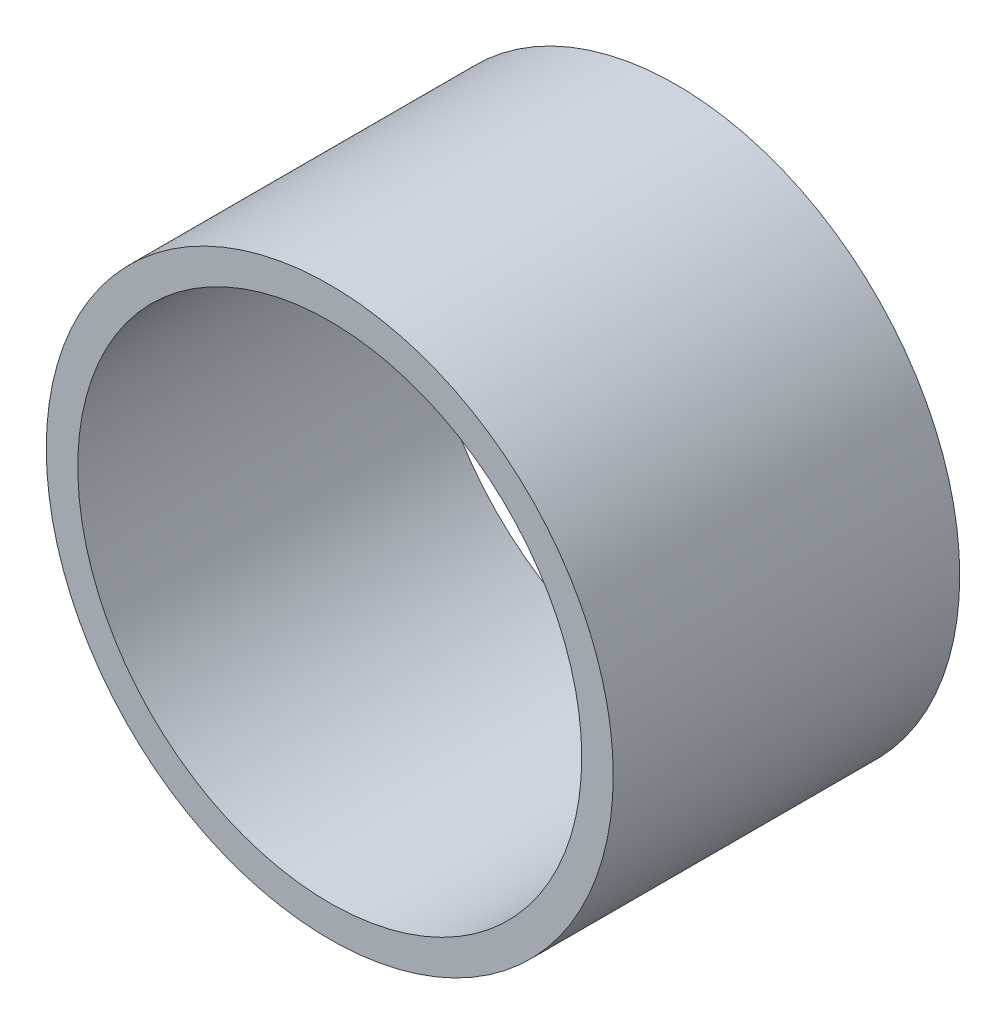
from build123d import *

# Parameters (mm, degrees)
ESQUISSE1_R          = 18
ESQUISSE1_R_2        = 16
BASE_EXTRUSION_DEPTH = 22


with BuildPart() as part:
    # Esquisse1 → Base-Extrusion (new body)
    with BuildSketch(Plane.XY):
        Circle(ESQUISSE1_R)
        Circle(ESQUISSE1_R_2, mode=Mode.SUBTRACT)
    extrude(amount=BASE_EXTRUSION_DEPTH)


solid = part.part
